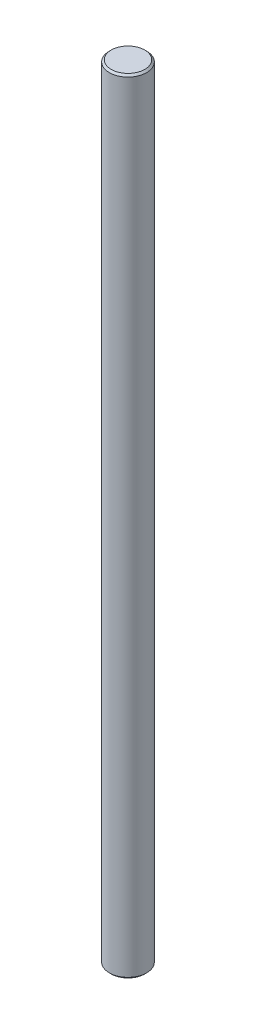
from build123d import *

# Parameters (mm, degrees)
ESQUISSE1_R        = 10
BOSS_EXTRU_1_DEPTH = 420
CHANFREIN1_SIZE    = 1


with BuildPart() as part:
    # Esquisse1 → Boss.-Extru.1 (new body)
    with BuildSketch(Plane(origin=(0, 0, 0), x_dir=(1, 0, 0), z_dir=(0, 1, 0))):
        with Locations(Location((0, 0, 0), (0, 0, 270))):
            Circle(ESQUISSE1_R)
    extrude(amount=BOSS_EXTRU_1_DEPTH)

    # Chanfrein1
    chanfrein1_edges = [part.edges().sort_by_distance(p)[0] for p in [
        (0, 0, -10),
        (0, 420, -10),
    ]]
    chamfer(chanfrein1_edges, length=CHANFREIN1_SIZE)


solid = part.part
